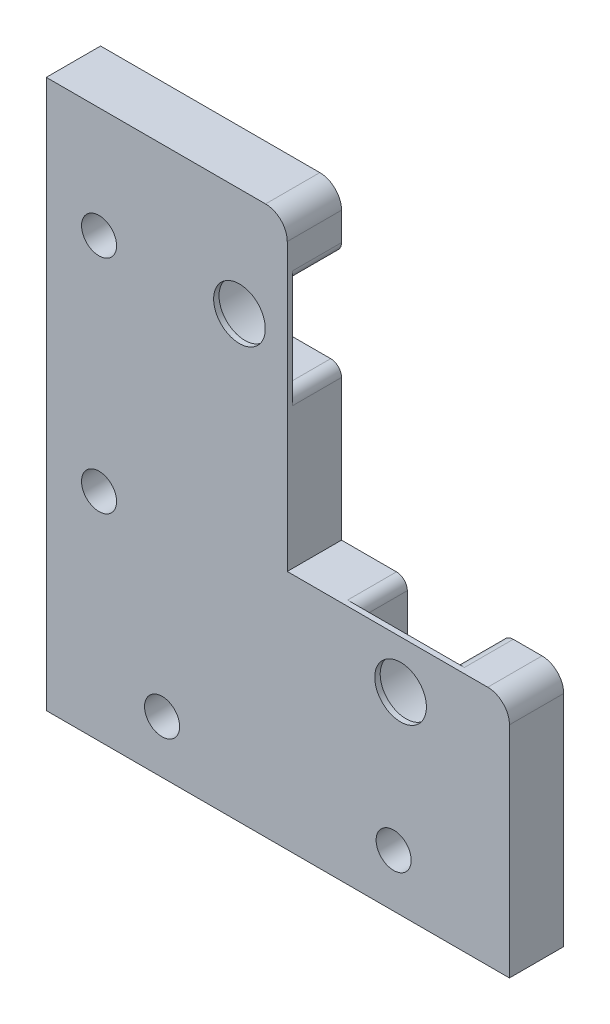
ISO-10303-21;
HEADER;
FILE_DESCRIPTION(('STEP AP214'),'2;1');
FILE_NAME('part.step','',(''),(''),'','','');
FILE_SCHEMA(('AUTOMOTIVE_DESIGN { 1 0 10303 214 1 1 1 1 }'));
ENDSEC;
DATA;
#1=APPLICATION_CONTEXT('core data for automotive mechanical design processes');
#2=APPLICATION_PROTOCOL_DEFINITION('international standard','automotive_design',2000,#1);
#3=PRODUCT_CONTEXT('',#1,'mechanical');
#4=PRODUCT('Part','Part','',(#3));
#5=PRODUCT_RELATED_PRODUCT_CATEGORY('part','',(#4));
#6=PRODUCT_DEFINITION_FORMATION('','',#4);
#7=PRODUCT_DEFINITION_CONTEXT('part definition',#1,'design');
#8=PRODUCT_DEFINITION('design','',#6,#7);
#9=PRODUCT_DEFINITION_SHAPE('','',#8);
#10=(LENGTH_UNIT() NAMED_UNIT(*) SI_UNIT(.MILLI.,.METRE.));
#11=(NAMED_UNIT(*) PLANE_ANGLE_UNIT() SI_UNIT($,.RADIAN.));
#12=(NAMED_UNIT(*) SI_UNIT($,.STERADIAN.) SOLID_ANGLE_UNIT());
#13=UNCERTAINTY_MEASURE_WITH_UNIT(LENGTH_MEASURE(1.E-05),#10,'distance_accuracy_value','');
#14=(GEOMETRIC_REPRESENTATION_CONTEXT(3) GLOBAL_UNCERTAINTY_ASSIGNED_CONTEXT((#13)) GLOBAL_UNIT_ASSIGNED_CONTEXT((#10,
#11,#12)) REPRESENTATION_CONTEXT('',''));
#15=CARTESIAN_POINT('',(0.,0.,0.));
#16=DIRECTION('',(0.,0.,1.));
#17=DIRECTION('',(1.,0.,0.));
#18=AXIS2_PLACEMENT_3D('',#15,#16,#17);
#19=CARTESIAN_POINT('',(0.,0.,-84.4296));
#20=DIRECTION('',(0.,0.,1.));
#21=DIRECTION('',(1.,0.,0.));
#22=AXIS2_PLACEMENT_3D('',#19,#20,#21);
#23=PLANE('',#22);
#24=CARTESIAN_POINT('',(-827.241549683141,599.958054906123,-84.4296));
#25=DIRECTION('',(0.,0.,1.));
#26=DIRECTION('',(1.,0.,0.));
#27=AXIS2_PLACEMENT_3D('',#24,#25,#26);
#28=CIRCLE('',#27,3.31999999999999);
#29=CARTESIAN_POINT('',(-823.921549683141,599.958054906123,-84.4296));
#30=VERTEX_POINT('',#29);
#31=EDGE_CURVE('E490',#30,#30,#28,.T.);
#32=ORIENTED_EDGE('',*,*,#31,.T.);
#33=EDGE_LOOP('',(#32));
#34=FACE_BOUND('',#33,.T.);
#35=CARTESIAN_POINT('',(-827.241549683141,574.047256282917,-84.4296));
#36=DIRECTION('',(0.,0.,1.));
#37=DIRECTION('',(1.,0.,0.));
#38=AXIS2_PLACEMENT_3D('',#35,#36,#37);
#39=CIRCLE('',#38,3.31999999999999);
#40=CARTESIAN_POINT('',(-823.921549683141,574.047256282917,-84.4296));
#41=VERTEX_POINT('',#40);
#42=EDGE_CURVE('E487',#41,#41,#39,.T.);
#43=ORIENTED_EDGE('',*,*,#42,.T.);
#44=EDGE_LOOP('',(#43));
#45=FACE_BOUND('',#44,.T.);
#46=CARTESIAN_POINT('',(-819.866559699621,554.919656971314,-84.4296));
#47=DIRECTION('',(0.,0.,1.));
#48=DIRECTION('',(1.,0.,0.));
#49=AXIS2_PLACEMENT_3D('',#46,#47,#48);
#50=CIRCLE('',#49,3.31999999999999);
#51=CARTESIAN_POINT('',(-816.546559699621,554.919656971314,-84.4296));
#52=VERTEX_POINT('',#51);
#53=EDGE_CURVE('E484',#52,#52,#50,.T.);
#54=ORIENTED_EDGE('',*,*,#53,.T.);
#55=EDGE_LOOP('',(#54));
#56=FACE_BOUND('',#55,.T.);
#57=CARTESIAN_POINT('',(-792.772179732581,554.919656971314,-84.4296));
#58=DIRECTION('',(0.,0.,1.));
#59=DIRECTION('',(1.,0.,0.));
#60=AXIS2_PLACEMENT_3D('',#57,#58,#59);
#61=CIRCLE('',#60,3.31999999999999);
#62=CARTESIAN_POINT('',(-789.452179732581,554.919656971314,-84.4296));
#63=VERTEX_POINT('',#62);
#64=EDGE_CURVE('E481',#63,#63,#61,.T.);
#65=ORIENTED_EDGE('',*,*,#64,.T.);
#66=EDGE_LOOP('',(#65));
#67=FACE_BOUND('',#66,.T.);
#68=DIRECTION('',(0.,1.,0.));
#69=VECTOR('',#68,1.);
#70=CARTESIAN_POINT('',(-833.413749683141,0.,-84.4296));
#71=LINE('',#70,#69);
#72=CARTESIAN_POINT('',(-833.413749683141,548.747456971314,-84.4296));
#73=VERTEX_POINT('',#72);
#74=CARTESIAN_POINT('',(-833.413749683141,612.913454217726,-84.4296));
#75=VERTEX_POINT('',#74);
#76=EDGE_CURVE('E267',#73,#75,#71,.T.);
#77=ORIENTED_EDGE('',*,*,#76,.T.);
#78=DIRECTION('',(1.,0.,0.));
#79=VECTOR('',#78,1.);
#80=CARTESIAN_POINT('',(-827.063749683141,612.913454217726,-84.4296));
#81=LINE('',#80,#79);
#82=CARTESIAN_POINT('',(-807.759749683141,612.913454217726,-84.4296));
#83=VERTEX_POINT('',#82);
#84=EDGE_CURVE('E255',#75,#83,#81,.T.);
#85=ORIENTED_EDGE('',*,*,#84,.T.);
#86=CARTESIAN_POINT('',(-807.759749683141,610.373454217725,-84.4296));
#87=DIRECTION('',(0.,0.,1.));
#88=DIRECTION('',(1.,0.,0.));
#89=AXIS2_PLACEMENT_3D('',#86,#87,#88);
#90=CIRCLE('',#89,2.54);
#91=CARTESIAN_POINT('',(-805.219749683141,610.373454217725,-84.4296));
#92=VERTEX_POINT('',#91);
#93=EDGE_CURVE('E114',#83,#92,#90,.F.);
#94=ORIENTED_EDGE('',*,*,#93,.T.);
#95=DIRECTION('',(0.,-1.,0.));
#96=VECTOR('',#95,1.);
#97=CARTESIAN_POINT('',(-805.219749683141,612.913454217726,-84.4296));
#98=LINE('',#97,#96);
#99=CARTESIAN_POINT('',(-805.219749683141,607.091256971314,-84.4296));
#100=VERTEX_POINT('',#99);
#101=EDGE_CURVE('E355',#92,#100,#98,.T.);
#102=ORIENTED_EDGE('',*,*,#101,.T.);
#103=CARTESIAN_POINT('',(-806.489749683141,607.091256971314,-84.4296));
#104=DIRECTION('',(0.,0.,1.));
#105=DIRECTION('',(1.,0.,0.));
#106=AXIS2_PLACEMENT_3D('',#103,#104,#105);
#107=CIRCLE('',#106,1.27);
#108=CARTESIAN_POINT('',(-806.489749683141,605.821256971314,-84.4296));
#109=VERTEX_POINT('',#108);
#110=EDGE_CURVE('E417',#100,#109,#107,.F.);
#111=ORIENTED_EDGE('',*,*,#110,.T.);
#112=DIRECTION('',(1.,0.,0.));
#113=VECTOR('',#112,1.);
#114=CARTESIAN_POINT('',(0.,605.821256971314,-84.4296));
#115=LINE('',#114,#113);
#116=CARTESIAN_POINT('',(-810.814099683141,605.821256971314,-84.4296));
#117=VERTEX_POINT('',#116);
#118=EDGE_CURVE('E335',#117,#109,#115,.T.);
#119=ORIENTED_EDGE('',*,*,#118,.F.);
#120=CARTESIAN_POINT('',(-810.814099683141,600.258656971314,-84.4296));
#121=DIRECTION('',(0.,0.,-1.));
#122=DIRECTION('',(-1.,0.,0.));
#123=AXIS2_PLACEMENT_3D('',#120,#121,#122);
#124=CIRCLE('',#123,5.56260000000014);
#125=CARTESIAN_POINT('',(-810.814099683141,594.696056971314,-84.4296));
#126=VERTEX_POINT('',#125);
#127=EDGE_CURVE('E310',#126,#117,#124,.T.);
#128=ORIENTED_EDGE('',*,*,#127,.F.);
#129=DIRECTION('',(1.,0.,0.));
#130=VECTOR('',#129,1.);
#131=CARTESIAN_POINT('',(0.,594.696056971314,-84.4296));
#132=LINE('',#131,#130);
#133=CARTESIAN_POINT('',(-806.489749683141,594.696056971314,-84.4296));
#134=VERTEX_POINT('',#133);
#135=EDGE_CURVE('E331',#126,#134,#132,.T.);
#136=ORIENTED_EDGE('',*,*,#135,.T.);
#137=CARTESIAN_POINT('',(-806.489749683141,593.426056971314,-84.4296));
#138=DIRECTION('',(0.,0.,1.));
#139=DIRECTION('',(1.,0.,0.));
#140=AXIS2_PLACEMENT_3D('',#137,#138,#139);
#141=CIRCLE('',#140,1.27);
#142=CARTESIAN_POINT('',(-805.219749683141,593.426056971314,-84.4296));
#143=VERTEX_POINT('',#142);
#144=EDGE_CURVE('E414',#134,#143,#141,.F.);
#145=ORIENTED_EDGE('',*,*,#144,.T.);
#146=CARTESIAN_POINT('',(-805.219749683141,576.941456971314,-84.4296));
#147=VERTEX_POINT('',#146);
#148=EDGE_CURVE('E359',#143,#147,#98,.T.);
#149=ORIENTED_EDGE('',*,*,#148,.T.);
#150=DIRECTION('',(1.,0.,0.));
#151=VECTOR('',#150,1.);
#152=CARTESIAN_POINT('',(-805.219749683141,576.941456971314,-84.4296));
#153=LINE('',#152,#151);
#154=CARTESIAN_POINT('',(-798.793549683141,576.941456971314,-84.4296));
#155=VERTEX_POINT('',#154);
#156=EDGE_CURVE('E256',#147,#155,#153,.T.);
#157=ORIENTED_EDGE('',*,*,#156,.T.);
#158=CARTESIAN_POINT('',(-798.793549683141,575.671456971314,-84.4296));
#159=DIRECTION('',(0.,0.,1.));
#160=DIRECTION('',(1.,0.,0.));
#161=AXIS2_PLACEMENT_3D('',#158,#159,#160);
#162=CIRCLE('',#161,1.27);
#163=CARTESIAN_POINT('',(-797.523549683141,575.671456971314,-84.4296));
#164=VERTEX_POINT('',#163);
#165=EDGE_CURVE('E411',#155,#164,#162,.F.);
#166=ORIENTED_EDGE('',*,*,#165,.T.);
#167=DIRECTION('',(0.,1.,0.));
#168=VECTOR('',#167,1.);
#169=CARTESIAN_POINT('',(-797.523549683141,0.,-84.4296));
#170=LINE('',#169,#168);
#171=CARTESIAN_POINT('',(-797.523549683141,571.347106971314,-84.4296));
#172=VERTEX_POINT('',#171);
#173=EDGE_CURVE('E309',#172,#164,#170,.T.);
#174=ORIENTED_EDGE('',*,*,#173,.F.);
#175=CARTESIAN_POINT('',(-791.960949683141,571.347106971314,-84.4296));
#176=DIRECTION('',(0.,0.,-1.));
#177=DIRECTION('',(-1.,0.,0.));
#178=AXIS2_PLACEMENT_3D('',#175,#176,#177);
#179=CIRCLE('',#178,5.5626);
#180=CARTESIAN_POINT('',(-786.398349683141,571.347106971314,-84.4296));
#181=VERTEX_POINT('',#180);
#182=EDGE_CURVE('E306',#181,#172,#179,.T.);
#183=ORIENTED_EDGE('',*,*,#182,.F.);
#184=DIRECTION('',(0.,1.,0.));
#185=VECTOR('',#184,1.);
#186=CARTESIAN_POINT('',(-786.398349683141,0.,-84.4296));
#187=LINE('',#186,#185);
#188=CARTESIAN_POINT('',(-786.398349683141,575.671456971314,-84.4296));
#189=VERTEX_POINT('',#188);
#190=EDGE_CURVE('E294',#181,#189,#187,.T.);
#191=ORIENTED_EDGE('',*,*,#190,.T.);
#192=CARTESIAN_POINT('',(-785.128349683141,575.671456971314,-84.4296));
#193=DIRECTION('',(0.,0.,1.));
#194=DIRECTION('',(1.,0.,0.));
#195=AXIS2_PLACEMENT_3D('',#192,#193,#194);
#196=CIRCLE('',#195,1.27);
#197=CARTESIAN_POINT('',(-785.128349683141,576.941456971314,-84.4296));
#198=VERTEX_POINT('',#197);
#199=EDGE_CURVE('E408',#189,#198,#196,.F.);
#200=ORIENTED_EDGE('',*,*,#199,.T.);
#201=CARTESIAN_POINT('',(-781.764989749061,576.941456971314,-84.4296));
#202=VERTEX_POINT('',#201);
#203=EDGE_CURVE('E358',#198,#202,#153,.T.);
#204=ORIENTED_EDGE('',*,*,#203,.T.);
#205=CARTESIAN_POINT('',(-781.764989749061,574.401456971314,-84.4296));
#206=DIRECTION('',(0.,0.,1.));
#207=DIRECTION('',(1.,0.,0.));
#208=AXIS2_PLACEMENT_3D('',#205,#206,#207);
#209=CIRCLE('',#208,2.54);
#210=CARTESIAN_POINT('',(-779.224989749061,574.401456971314,-84.4296));
#211=VERTEX_POINT('',#210);
#212=EDGE_CURVE('E250',#202,#211,#209,.F.);
#213=ORIENTED_EDGE('',*,*,#212,.T.);
#214=DIRECTION('',(0.,-1.,0.));
#215=VECTOR('',#214,1.);
#216=CARTESIAN_POINT('',(-779.224989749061,576.941456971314,-84.4296));
#217=LINE('',#216,#215);
#218=CARTESIAN_POINT('',(-779.224989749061,548.747456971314,-84.4296));
#219=VERTEX_POINT('',#218);
#220=EDGE_CURVE('E243',#211,#219,#217,.T.);
#221=ORIENTED_EDGE('',*,*,#220,.T.);
#222=DIRECTION('',(-1.,0.,0.));
#223=VECTOR('',#222,1.);
#224=CARTESIAN_POINT('',(0.,548.747456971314,-84.4296));
#225=LINE('',#224,#223);
#226=EDGE_CURVE('E247',#219,#73,#225,.T.);
#227=ORIENTED_EDGE('',*,*,#226,.T.);
#228=EDGE_LOOP('',(#77,#85,#94,#102,#111,#119,#128,#136,#145,#149,#157,#166,#174,#183,#191,#200,
#204,#213,#221,#227));
#229=FACE_BOUND('',#228,.T.);
#230=ADVANCED_FACE('F91',(#34,#45,#56,#67,#229),#23,.F.);
#231=CARTESIAN_POINT('',(0.,0.,-78.0796));
#232=DIRECTION('',(0.,0.,-1.));
#233=DIRECTION('',(-1.,0.,0.));
#234=AXIS2_PLACEMENT_3D('',#231,#232,#233);
#235=PLANE('',#234);
#236=CARTESIAN_POINT('',(-792.772179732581,554.919656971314,-78.0796));
#237=DIRECTION('',(0.,0.,-1.));
#238=DIRECTION('',(-1.,0.,0.));
#239=AXIS2_PLACEMENT_3D('',#236,#237,#238);
#240=CIRCLE('',#239,2.05000000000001);
#241=CARTESIAN_POINT('',(-794.822179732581,554.919656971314,-78.0796));
#242=VERTEX_POINT('',#241);
#243=EDGE_CURVE('E272',#242,#242,#240,.T.);
#244=ORIENTED_EDGE('',*,*,#243,.T.);
#245=EDGE_LOOP('',(#244));
#246=FACE_BOUND('',#245,.T.);
#247=CARTESIAN_POINT('',(-827.241549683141,599.958054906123,-78.0796));
#248=DIRECTION('',(0.,0.,-1.));
#249=DIRECTION('',(-1.,0.,0.));
#250=AXIS2_PLACEMENT_3D('',#247,#248,#249);
#251=CIRCLE('',#250,2.05000000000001);
#252=CARTESIAN_POINT('',(-829.291549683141,599.958054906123,-78.0796));
#253=VERTEX_POINT('',#252);
#254=EDGE_CURVE('E532',#253,#253,#251,.T.);
#255=ORIENTED_EDGE('',*,*,#254,.T.);
#256=EDGE_LOOP('',(#255));
#257=FACE_BOUND('',#256,.T.);
#258=DIRECTION('',(1.,0.,0.));
#259=VECTOR('',#258,1.);
#260=CARTESIAN_POINT('',(0.,548.747456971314,-78.0796));
#261=LINE('',#260,#259);
#262=CARTESIAN_POINT('',(-833.413749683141,548.747456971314,-78.0796));
#263=VERTEX_POINT('',#262);
#264=CARTESIAN_POINT('',(-779.224989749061,548.747456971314,-78.0796));
#265=VERTEX_POINT('',#264);
#266=EDGE_CURVE('E286',#263,#265,#261,.T.);
#267=ORIENTED_EDGE('',*,*,#266,.T.);
#268=DIRECTION('',(0.,-1.,0.));
#269=VECTOR('',#268,1.);
#270=CARTESIAN_POINT('',(-779.224989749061,562.158656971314,-78.0796));
#271=LINE('',#270,#269);
#272=CARTESIAN_POINT('',(-779.224989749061,574.401456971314,-78.0796));
#273=VERTEX_POINT('',#272);
#274=EDGE_CURVE('E262',#273,#265,#271,.T.);
#275=ORIENTED_EDGE('',*,*,#274,.F.);
#276=CARTESIAN_POINT('',(-781.764989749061,574.401456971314,-78.0796));
#277=DIRECTION('',(0.,0.,-1.));
#278=DIRECTION('',(-1.,0.,0.));
#279=AXIS2_PLACEMENT_3D('',#276,#277,#278);
#280=CIRCLE('',#279,2.54);
#281=CARTESIAN_POINT('',(-781.764989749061,576.941456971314,-78.0796));
#282=VERTEX_POINT('',#281);
#283=EDGE_CURVE('E462',#273,#282,#280,.F.);
#284=ORIENTED_EDGE('',*,*,#283,.T.);
#285=DIRECTION('',(1.,0.,0.));
#286=VECTOR('',#285,1.);
#287=CARTESIAN_POINT('',(-804.660949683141,576.941456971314,-78.0796));
#288=LINE('',#287,#286);
#289=CARTESIAN_POINT('',(-805.219749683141,576.941456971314,-78.0796));
#290=VERTEX_POINT('',#289);
#291=EDGE_CURVE('E379',#290,#282,#288,.T.);
#292=ORIENTED_EDGE('',*,*,#291,.F.);
#293=DIRECTION('',(0.,-1.,0.));
#294=VECTOR('',#293,1.);
#295=CARTESIAN_POINT('',(-805.219749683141,612.913454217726,-78.0796));
#296=LINE('',#295,#294);
#297=CARTESIAN_POINT('',(-805.219749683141,610.373454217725,-78.0796));
#298=VERTEX_POINT('',#297);
#299=EDGE_CURVE('E388',#298,#290,#296,.T.);
#300=ORIENTED_EDGE('',*,*,#299,.F.);
#301=CARTESIAN_POINT('',(-807.759749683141,610.373454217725,-78.0796));
#302=DIRECTION('',(0.,0.,-1.));
#303=DIRECTION('',(-1.,0.,0.));
#304=AXIS2_PLACEMENT_3D('',#301,#302,#303);
#305=CIRCLE('',#304,2.54);
#306=CARTESIAN_POINT('',(-807.759749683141,612.913454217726,-78.0796));
#307=VERTEX_POINT('',#306);
#308=EDGE_CURVE('E459',#298,#307,#305,.F.);
#309=ORIENTED_EDGE('',*,*,#308,.T.);
#310=DIRECTION('',(1.,0.,0.));
#311=VECTOR('',#310,1.);
#312=CARTESIAN_POINT('',(-820.002549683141,612.913454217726,-78.0796));
#313=LINE('',#312,#311);
#314=CARTESIAN_POINT('',(-833.413749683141,612.913454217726,-78.0796));
#315=VERTEX_POINT('',#314);
#316=EDGE_CURVE('E385',#315,#307,#313,.T.);
#317=ORIENTED_EDGE('',*,*,#316,.F.);
#318=DIRECTION('',(0.,-1.,0.));
#319=VECTOR('',#318,1.);
#320=CARTESIAN_POINT('',(-833.413749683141,0.,-78.0796));
#321=LINE('',#320,#319);
#322=EDGE_CURVE('E279',#315,#263,#321,.T.);
#323=ORIENTED_EDGE('',*,*,#322,.T.);
#324=EDGE_LOOP('',(#267,#275,#284,#292,#300,#309,#317,#323));
#325=FACE_BOUND('',#324,.T.);
#326=CARTESIAN_POINT('',(-810.814099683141,600.258656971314,-78.0796));
#327=DIRECTION('',(0.,0.,1.));
#328=DIRECTION('',(-1.,0.,0.));
#329=AXIS2_PLACEMENT_3D('',#326,#327,#328);
#330=CIRCLE('',#329,3.0226);
#331=CARTESIAN_POINT('',(-813.836699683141,600.258656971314,-78.0796));
#332=VERTEX_POINT('',#331);
#333=EDGE_CURVE('E365',#332,#332,#330,.T.);
#334=ORIENTED_EDGE('',*,*,#333,.F.);
#335=EDGE_LOOP('',(#334));
#336=FACE_BOUND('',#335,.T.);
#337=CARTESIAN_POINT('',(-791.960949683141,571.347106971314,-78.0796));
#338=DIRECTION('',(0.,0.,1.));
#339=DIRECTION('',(-1.,0.,0.));
#340=AXIS2_PLACEMENT_3D('',#337,#338,#339);
#341=CIRCLE('',#340,3.0226);
#342=CARTESIAN_POINT('',(-794.983549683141,571.347106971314,-78.0796));
#343=VERTEX_POINT('',#342);
#344=EDGE_CURVE('E372',#343,#343,#341,.T.);
#345=ORIENTED_EDGE('',*,*,#344,.F.);
#346=EDGE_LOOP('',(#345));
#347=FACE_BOUND('',#346,.T.);
#348=CARTESIAN_POINT('',(-827.241549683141,574.047256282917,-78.0796));
#349=DIRECTION('',(0.,0.,-1.));
#350=DIRECTION('',(-1.,0.,0.));
#351=AXIS2_PLACEMENT_3D('',#348,#349,#350);
#352=CIRCLE('',#351,2.05000000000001);
#353=CARTESIAN_POINT('',(-829.291549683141,574.047256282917,-78.0796));
#354=VERTEX_POINT('',#353);
#355=EDGE_CURVE('E541',#354,#354,#352,.F.);
#356=ORIENTED_EDGE('',*,*,#355,.F.);
#357=EDGE_LOOP('',(#356));
#358=FACE_BOUND('',#357,.T.);
#359=CARTESIAN_POINT('',(-819.866559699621,554.919656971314,-78.0796));
#360=DIRECTION('',(0.,0.,-1.));
#361=DIRECTION('',(-1.,0.,0.));
#362=AXIS2_PLACEMENT_3D('',#359,#360,#361);
#363=CIRCLE('',#362,2.05000000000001);
#364=CARTESIAN_POINT('',(-821.916559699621,554.919656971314,-78.0796));
#365=VERTEX_POINT('',#364);
#366=EDGE_CURVE('E276',#365,#365,#363,.F.);
#367=ORIENTED_EDGE('',*,*,#366,.F.);
#368=EDGE_LOOP('',(#367));
#369=FACE_BOUND('',#368,.T.);
#370=ADVANCED_FACE('F509',(#246,#257,#325,#336,#347,#358,#369),#235,.F.);
#371=CARTESIAN_POINT('',(-804.660949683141,576.941456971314,-80.6196));
#372=DIRECTION('',(0.,-1.,0.));
#373=DIRECTION('',(0.,0.,-1.));
#374=AXIS2_PLACEMENT_3D('',#371,#372,#373);
#375=PLANE('',#374);
#376=ORIENTED_EDGE('',*,*,#291,.T.);
#377=DIRECTION('',(0.,0.,1.));
#378=VECTOR('',#377,1.);
#379=CARTESIAN_POINT('',(-781.764989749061,576.941456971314,-84.4296));
#380=LINE('',#379,#378);
#381=EDGE_CURVE('E465',#282,#202,#380,.F.);
#382=ORIENTED_EDGE('',*,*,#381,.T.);
#383=ORIENTED_EDGE('',*,*,#203,.F.);
#384=DIRECTION('',(0.,0.,-1.));
#385=VECTOR('',#384,1.);
#386=CARTESIAN_POINT('',(-785.128349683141,576.941456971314,-78.7146));
#387=LINE('',#386,#385);
#388=CARTESIAN_POINT('',(-785.128349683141,576.941456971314,-78.7146));
#389=VERTEX_POINT('',#388);
#390=EDGE_CURVE('E427',#198,#389,#387,.F.);
#391=ORIENTED_EDGE('',*,*,#390,.T.);
#392=DIRECTION('',(1.,0.,0.));
#393=VECTOR('',#392,1.);
#394=CARTESIAN_POINT('',(0.,576.941456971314,-78.7146));
#395=LINE('',#394,#393);
#396=CARTESIAN_POINT('',(-798.793549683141,576.941456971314,-78.7146));
#397=VERTEX_POINT('',#396);
#398=EDGE_CURVE('E298',#397,#389,#395,.T.);
#399=ORIENTED_EDGE('',*,*,#398,.F.);
#400=DIRECTION('',(0.,0.,-1.));
#401=VECTOR('',#400,1.);
#402=CARTESIAN_POINT('',(-798.793549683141,576.941456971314,-80.6196));
#403=LINE('',#402,#401);
#404=EDGE_CURVE('E431',#397,#155,#403,.T.);
#405=ORIENTED_EDGE('',*,*,#404,.T.);
#406=ORIENTED_EDGE('',*,*,#156,.F.);
#407=DIRECTION('',(0.,0.,1.));
#408=VECTOR('',#407,1.);
#409=CARTESIAN_POINT('',(-805.219749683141,576.941456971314,-80.6196));
#410=LINE('',#409,#408);
#411=EDGE_CURVE('E391',#147,#290,#410,.T.);
#412=ORIENTED_EDGE('',*,*,#411,.T.);
#413=EDGE_LOOP('',(#376,#382,#383,#391,#399,#405,#406,#412));
#414=FACE_BOUND('',#413,.T.);
#415=ADVANCED_FACE('F527',(#414),#375,.F.);
#416=CARTESIAN_POINT('',(-805.219749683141,612.913454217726,-80.6196));
#417=DIRECTION('',(-1.,0.,0.));
#418=DIRECTION('',(0.,0.,1.));
#419=AXIS2_PLACEMENT_3D('',#416,#417,#418);
#420=PLANE('',#419);
#421=ORIENTED_EDGE('',*,*,#101,.F.);
#422=DIRECTION('',(0.,0.,1.));
#423=VECTOR('',#422,1.);
#424=CARTESIAN_POINT('',(-805.219749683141,610.373454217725,-78.0796));
#425=LINE('',#424,#423);
#426=EDGE_CURVE('E472',#92,#298,#425,.T.);
#427=ORIENTED_EDGE('',*,*,#426,.T.);
#428=ORIENTED_EDGE('',*,*,#299,.T.);
#429=ORIENTED_EDGE('',*,*,#411,.F.);
#430=ORIENTED_EDGE('',*,*,#148,.F.);
#431=DIRECTION('',(0.,0.,-1.));
#432=VECTOR('',#431,1.);
#433=CARTESIAN_POINT('',(-805.219749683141,593.426056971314,-78.7146));
#434=LINE('',#433,#432);
#435=CARTESIAN_POINT('',(-805.219749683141,593.426056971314,-78.7146));
#436=VERTEX_POINT('',#435);
#437=EDGE_CURVE('E395',#143,#436,#434,.F.);
#438=ORIENTED_EDGE('',*,*,#437,.T.);
#439=DIRECTION('',(0.,-1.,0.));
#440=VECTOR('',#439,1.);
#441=CARTESIAN_POINT('',(-805.219749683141,0.,-78.7146));
#442=LINE('',#441,#440);
#443=CARTESIAN_POINT('',(-805.219749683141,607.091256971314,-78.7146));
#444=VERTEX_POINT('',#443);
#445=EDGE_CURVE('E345',#444,#436,#442,.T.);
#446=ORIENTED_EDGE('',*,*,#445,.F.);
#447=DIRECTION('',(0.,0.,-1.));
#448=VECTOR('',#447,1.);
#449=CARTESIAN_POINT('',(-805.219749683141,607.091256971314,-80.6196));
#450=LINE('',#449,#448);
#451=EDGE_CURVE('E404',#444,#100,#450,.T.);
#452=ORIENTED_EDGE('',*,*,#451,.T.);
#453=EDGE_LOOP('',(#421,#427,#428,#429,#430,#438,#446,#452));
#454=FACE_BOUND('',#453,.T.);
#455=ADVANCED_FACE('F607',(#454),#420,.F.);
#456=CARTESIAN_POINT('',(-791.960949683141,571.347106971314,-78.0796));
#457=DIRECTION('',(0.,0.,-1.));
#458=DIRECTION('',(-1.,0.,0.));
#459=AXIS2_PLACEMENT_3D('',#456,#457,#458);
#460=CYLINDRICAL_SURFACE('',#459,3.0226);
#461=CARTESIAN_POINT('',(-791.960949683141,571.347106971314,-78.7146));
#462=DIRECTION('',(0.,0.,-1.));
#463=DIRECTION('',(-1.,0.,0.));
#464=AXIS2_PLACEMENT_3D('',#461,#462,#463);
#465=CIRCLE('',#464,3.0226);
#466=CARTESIAN_POINT('',(-794.983549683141,571.347106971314,-78.7146));
#467=VERTEX_POINT('',#466);
#468=EDGE_CURVE('E398',#467,#467,#465,.F.);
#469=ORIENTED_EDGE('',*,*,#468,.F.);
#470=DIRECTION('',(0.,0.,-1.));
#471=VECTOR('',#470,1.);
#472=CARTESIAN_POINT('',(-794.983549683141,571.347106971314,-78.0796));
#473=LINE('',#472,#471);
#474=EDGE_CURVE('E375',#343,#467,#473,.T.);
#475=ORIENTED_EDGE('',*,*,#474,.F.);
#476=ORIENTED_EDGE('',*,*,#344,.T.);
#477=ORIENTED_EDGE('',*,*,#474,.T.);
#478=EDGE_LOOP('',(#469,#475,#476,#477));
#479=FACE_BOUND('',#478,.T.);
#480=ADVANCED_FACE('F604',(#479),#460,.F.);
#481=CARTESIAN_POINT('',(-810.814099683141,600.258656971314,-78.0796));
#482=DIRECTION('',(0.,0.,-1.));
#483=DIRECTION('',(-1.,0.,0.));
#484=AXIS2_PLACEMENT_3D('',#481,#482,#483);
#485=CYLINDRICAL_SURFACE('',#484,3.0226);
#486=CARTESIAN_POINT('',(-810.814099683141,600.258656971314,-78.7146));
#487=DIRECTION('',(0.,0.,-1.));
#488=DIRECTION('',(-1.,0.,0.));
#489=AXIS2_PLACEMENT_3D('',#486,#487,#488);
#490=CIRCLE('',#489,3.0226);
#491=CARTESIAN_POINT('',(-813.836699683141,600.258656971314,-78.7146));
#492=VERTEX_POINT('',#491);
#493=EDGE_CURVE('E320',#492,#492,#490,.F.);
#494=ORIENTED_EDGE('',*,*,#493,.F.);
#495=DIRECTION('',(0.,0.,-1.));
#496=VECTOR('',#495,1.);
#497=CARTESIAN_POINT('',(-813.836699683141,600.258656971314,-78.0796));
#498=LINE('',#497,#496);
#499=EDGE_CURVE('E368',#332,#492,#498,.T.);
#500=ORIENTED_EDGE('',*,*,#499,.F.);
#501=ORIENTED_EDGE('',*,*,#333,.T.);
#502=ORIENTED_EDGE('',*,*,#499,.T.);
#503=EDGE_LOOP('',(#494,#500,#501,#502));
#504=FACE_BOUND('',#503,.T.);
#505=ADVANCED_FACE('F601',(#504),#485,.F.);
#506=CARTESIAN_POINT('',(-779.224989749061,0.,6.35));
#507=DIRECTION('',(1.,0.,0.));
#508=DIRECTION('',(0.,0.,-1.));
#509=AXIS2_PLACEMENT_3D('',#506,#507,#508);
#510=PLANE('',#509);
#511=ORIENTED_EDGE('',*,*,#274,.T.);
#512=DIRECTION('',(0.,0.,-1.));
#513=VECTOR('',#512,1.);
#514=CARTESIAN_POINT('',(-779.224989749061,548.747456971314,5.90668998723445));
#515=LINE('',#514,#513);
#516=EDGE_CURVE('E259',#265,#219,#515,.T.);
#517=ORIENTED_EDGE('',*,*,#516,.T.);
#518=ORIENTED_EDGE('',*,*,#220,.F.);
#519=DIRECTION('',(0.,0.,1.));
#520=VECTOR('',#519,1.);
#521=CARTESIAN_POINT('',(-779.224989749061,574.401456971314,-78.0796));
#522=LINE('',#521,#520);
#523=EDGE_CURVE('E456',#211,#273,#522,.T.);
#524=ORIENTED_EDGE('',*,*,#523,.T.);
#525=EDGE_LOOP('',(#511,#517,#518,#524));
#526=FACE_BOUND('',#525,.T.);
#527=ADVANCED_FACE('F260',(#526),#510,.T.);
#528=CARTESIAN_POINT('',(0.,612.913454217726,6.35));
#529=DIRECTION('',(0.,1.,0.));
#530=DIRECTION('',(0.,0.,1.));
#531=AXIS2_PLACEMENT_3D('',#528,#529,#530);
#532=PLANE('',#531);
#533=ORIENTED_EDGE('',*,*,#84,.F.);
#534=DIRECTION('',(0.,0.,-1.));
#535=VECTOR('',#534,1.);
#536=CARTESIAN_POINT('',(-833.413749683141,612.913454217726,5.90668998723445));
#537=LINE('',#536,#535);
#538=EDGE_CURVE('E282',#315,#75,#537,.T.);
#539=ORIENTED_EDGE('',*,*,#538,.F.);
#540=ORIENTED_EDGE('',*,*,#316,.T.);
#541=DIRECTION('',(0.,0.,1.));
#542=VECTOR('',#541,1.);
#543=CARTESIAN_POINT('',(-807.759749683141,612.913454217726,-84.4296));
#544=LINE('',#543,#542);
#545=EDGE_CURVE('E107',#307,#83,#544,.F.);
#546=ORIENTED_EDGE('',*,*,#545,.T.);
#547=EDGE_LOOP('',(#533,#539,#540,#546));
#548=FACE_BOUND('',#547,.T.);
#549=ADVANCED_FACE('F598',(#548),#532,.T.);
#550=CARTESIAN_POINT('',(0.,0.,-78.7146));
#551=DIRECTION('',(0.,0.,-1.));
#552=DIRECTION('',(-1.,0.,0.));
#553=AXIS2_PLACEMENT_3D('',#550,#551,#552);
#554=PLANE('',#553);
#555=CARTESIAN_POINT('',(-810.814099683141,600.258656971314,-78.7146));
#556=DIRECTION('',(0.,0.,-1.));
#557=DIRECTION('',(-1.,0.,0.));
#558=AXIS2_PLACEMENT_3D('',#555,#556,#557);
#559=CIRCLE('',#558,5.56260000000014);
#560=CARTESIAN_POINT('',(-810.814099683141,594.696056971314,-78.7146));
#561=VERTEX_POINT('',#560);
#562=CARTESIAN_POINT('',(-810.814099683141,605.821256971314,-78.7146));
#563=VERTEX_POINT('',#562);
#564=EDGE_CURVE('E336',#561,#563,#559,.T.);
#565=ORIENTED_EDGE('',*,*,#564,.T.);
#566=DIRECTION('',(1.,0.,0.));
#567=VECTOR('',#566,1.);
#568=CARTESIAN_POINT('',(0.,605.821256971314,-78.7146));
#569=LINE('',#568,#567);
#570=CARTESIAN_POINT('',(-806.489749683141,605.821256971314,-78.7146));
#571=VERTEX_POINT('',#570);
#572=EDGE_CURVE('E348',#563,#571,#569,.T.);
#573=ORIENTED_EDGE('',*,*,#572,.T.);
#574=CARTESIAN_POINT('',(-806.489749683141,607.091256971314,-78.7146));
#575=DIRECTION('',(0.,0.,-1.));
#576=DIRECTION('',(-1.,0.,0.));
#577=AXIS2_PLACEMENT_3D('',#574,#575,#576);
#578=CIRCLE('',#577,1.27);
#579=EDGE_CURVE('E442',#571,#444,#578,.F.);
#580=ORIENTED_EDGE('',*,*,#579,.T.);
#581=ORIENTED_EDGE('',*,*,#445,.T.);
#582=CARTESIAN_POINT('',(-806.489749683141,593.426056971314,-78.7146));
#583=DIRECTION('',(0.,0.,-1.));
#584=DIRECTION('',(-1.,0.,0.));
#585=AXIS2_PLACEMENT_3D('',#582,#583,#584);
#586=CIRCLE('',#585,1.27);
#587=CARTESIAN_POINT('',(-806.489749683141,594.696056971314,-78.7146));
#588=VERTEX_POINT('',#587);
#589=EDGE_CURVE('E446',#436,#588,#586,.F.);
#590=ORIENTED_EDGE('',*,*,#589,.T.);
#591=DIRECTION('',(1.,0.,0.));
#592=VECTOR('',#591,1.);
#593=CARTESIAN_POINT('',(0.,594.696056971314,-78.7146));
#594=LINE('',#593,#592);
#595=EDGE_CURVE('E328',#561,#588,#594,.T.);
#596=ORIENTED_EDGE('',*,*,#595,.F.);
#597=EDGE_LOOP('',(#565,#573,#580,#581,#590,#596));
#598=FACE_BOUND('',#597,.T.);
#599=ORIENTED_EDGE('',*,*,#493,.T.);
#600=EDGE_LOOP('',(#599));
#601=FACE_BOUND('',#600,.T.);
#602=ADVANCED_FACE('F589',(#598,#601),#554,.T.);
#603=CARTESIAN_POINT('',(-810.814099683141,600.258656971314,-78.7146));
#604=DIRECTION('',(0.,0.,-1.));
#605=DIRECTION('',(-1.,0.,0.));
#606=AXIS2_PLACEMENT_3D('',#603,#604,#605);
#607=CYLINDRICAL_SURFACE('',#606,5.56260000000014);
#608=ORIENTED_EDGE('',*,*,#127,.T.);
#609=DIRECTION('',(0.,0.,-1.));
#610=VECTOR('',#609,1.);
#611=CARTESIAN_POINT('',(-810.814099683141,605.821256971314,-78.7146));
#612=LINE('',#611,#610);
#613=EDGE_CURVE('E324',#563,#117,#612,.T.);
#614=ORIENTED_EDGE('',*,*,#613,.F.);
#615=ORIENTED_EDGE('',*,*,#564,.F.);
#616=DIRECTION('',(0.,0.,-1.));
#617=VECTOR('',#616,1.);
#618=CARTESIAN_POINT('',(-810.814099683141,594.696056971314,-78.7146));
#619=LINE('',#618,#617);
#620=EDGE_CURVE('E288',#561,#126,#619,.T.);
#621=ORIENTED_EDGE('',*,*,#620,.T.);
#622=EDGE_LOOP('',(#608,#614,#615,#621));
#623=FACE_BOUND('',#622,.T.);
#624=ADVANCED_FACE('F585',(#623),#607,.F.);
#625=CARTESIAN_POINT('',(0.,594.696056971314,-78.7146));
#626=DIRECTION('',(0.,1.,0.));
#627=DIRECTION('',(0.,0.,1.));
#628=AXIS2_PLACEMENT_3D('',#625,#626,#627);
#629=PLANE('',#628);
#630=ORIENTED_EDGE('',*,*,#595,.T.);
#631=DIRECTION('',(0.,0.,-1.));
#632=VECTOR('',#631,1.);
#633=CARTESIAN_POINT('',(-806.489749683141,594.696056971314,-84.4296));
#634=LINE('',#633,#632);
#635=EDGE_CURVE('E423',#588,#134,#634,.T.);
#636=ORIENTED_EDGE('',*,*,#635,.T.);
#637=ORIENTED_EDGE('',*,*,#135,.F.);
#638=ORIENTED_EDGE('',*,*,#620,.F.);
#639=EDGE_LOOP('',(#630,#636,#637,#638));
#640=FACE_BOUND('',#639,.T.);
#641=ADVANCED_FACE('F588',(#640),#629,.T.);
#642=CARTESIAN_POINT('',(0.,605.821256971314,-78.7146));
#643=DIRECTION('',(0.,1.,0.));
#644=DIRECTION('',(0.,0.,1.));
#645=AXIS2_PLACEMENT_3D('',#642,#643,#644);
#646=PLANE('',#645);
#647=ORIENTED_EDGE('',*,*,#118,.T.);
#648=DIRECTION('',(0.,0.,-1.));
#649=VECTOR('',#648,1.);
#650=CARTESIAN_POINT('',(-806.489749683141,605.821256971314,-78.7146));
#651=LINE('',#650,#649);
#652=EDGE_CURVE('E420',#109,#571,#651,.F.);
#653=ORIENTED_EDGE('',*,*,#652,.T.);
#654=ORIENTED_EDGE('',*,*,#572,.F.);
#655=ORIENTED_EDGE('',*,*,#613,.T.);
#656=EDGE_LOOP('',(#647,#653,#654,#655));
#657=FACE_BOUND('',#656,.T.);
#658=ADVANCED_FACE('F571',(#657),#646,.F.);
#659=CARTESIAN_POINT('',(0.,0.,-78.7146));
#660=DIRECTION('',(0.,0.,-1.));
#661=DIRECTION('',(-1.,0.,0.));
#662=AXIS2_PLACEMENT_3D('',#659,#660,#661);
#663=PLANE('',#662);
#664=CARTESIAN_POINT('',(-791.960949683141,571.347106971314,-78.7146));
#665=DIRECTION('',(0.,0.,-1.));
#666=DIRECTION('',(-1.,0.,0.));
#667=AXIS2_PLACEMENT_3D('',#664,#665,#666);
#668=CIRCLE('',#667,5.5626);
#669=CARTESIAN_POINT('',(-786.398349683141,571.347106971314,-78.7146));
#670=VERTEX_POINT('',#669);
#671=CARTESIAN_POINT('',(-797.523549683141,571.347106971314,-78.7146));
#672=VERTEX_POINT('',#671);
#673=EDGE_CURVE('E289',#670,#672,#668,.T.);
#674=ORIENTED_EDGE('',*,*,#673,.T.);
#675=DIRECTION('',(0.,1.,0.));
#676=VECTOR('',#675,1.);
#677=CARTESIAN_POINT('',(-797.523549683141,0.,-78.7146));
#678=LINE('',#677,#676);
#679=CARTESIAN_POINT('',(-797.523549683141,575.671456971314,-78.7146));
#680=VERTEX_POINT('',#679);
#681=EDGE_CURVE('E293',#672,#680,#678,.T.);
#682=ORIENTED_EDGE('',*,*,#681,.T.);
#683=CARTESIAN_POINT('',(-798.793549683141,575.671456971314,-78.7146));
#684=DIRECTION('',(0.,0.,-1.));
#685=DIRECTION('',(-1.,0.,0.));
#686=AXIS2_PLACEMENT_3D('',#683,#684,#685);
#687=CIRCLE('',#686,1.27);
#688=EDGE_CURVE('E449',#680,#397,#687,.F.);
#689=ORIENTED_EDGE('',*,*,#688,.T.);
#690=ORIENTED_EDGE('',*,*,#398,.T.);
#691=CARTESIAN_POINT('',(-785.128349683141,575.671456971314,-78.7146));
#692=DIRECTION('',(0.,0.,-1.));
#693=DIRECTION('',(-1.,0.,0.));
#694=AXIS2_PLACEMENT_3D('',#691,#692,#693);
#695=CIRCLE('',#694,1.27);
#696=CARTESIAN_POINT('',(-786.398349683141,575.671456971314,-78.7146));
#697=VERTEX_POINT('',#696);
#698=EDGE_CURVE('E453',#389,#697,#695,.F.);
#699=ORIENTED_EDGE('',*,*,#698,.T.);
#700=DIRECTION('',(0.,1.,0.));
#701=VECTOR('',#700,1.);
#702=CARTESIAN_POINT('',(-786.398349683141,0.,-78.7146));
#703=LINE('',#702,#701);
#704=EDGE_CURVE('E301',#670,#697,#703,.T.);
#705=ORIENTED_EDGE('',*,*,#704,.F.);
#706=EDGE_LOOP('',(#674,#682,#689,#690,#699,#705));
#707=FACE_BOUND('',#706,.T.);
#708=ORIENTED_EDGE('',*,*,#468,.T.);
#709=EDGE_LOOP('',(#708));
#710=FACE_BOUND('',#709,.T.);
#711=ADVANCED_FACE('F567',(#707,#710),#663,.T.);
#712=CARTESIAN_POINT('',(-791.960949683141,571.347106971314,-78.7146));
#713=DIRECTION('',(0.,0.,-1.));
#714=DIRECTION('',(-1.,0.,0.));
#715=AXIS2_PLACEMENT_3D('',#712,#713,#714);
#716=CYLINDRICAL_SURFACE('',#715,5.5626);
#717=ORIENTED_EDGE('',*,*,#182,.T.);
#718=DIRECTION('',(0.,0.,-1.));
#719=VECTOR('',#718,1.);
#720=CARTESIAN_POINT('',(-797.523549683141,571.347106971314,-78.7146));
#721=LINE('',#720,#719);
#722=EDGE_CURVE('E305',#672,#172,#721,.T.);
#723=ORIENTED_EDGE('',*,*,#722,.F.);
#724=ORIENTED_EDGE('',*,*,#673,.F.);
#725=DIRECTION('',(0.,0.,-1.));
#726=VECTOR('',#725,1.);
#727=CARTESIAN_POINT('',(-786.398349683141,571.347106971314,-78.7146));
#728=LINE('',#727,#726);
#729=EDGE_CURVE('E317',#670,#181,#728,.T.);
#730=ORIENTED_EDGE('',*,*,#729,.T.);
#731=EDGE_LOOP('',(#717,#723,#724,#730));
#732=FACE_BOUND('',#731,.T.);
#733=ADVANCED_FACE('F570',(#732),#716,.F.);
#734=CARTESIAN_POINT('',(-786.398349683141,0.,-78.7146));
#735=DIRECTION('',(-1.,0.,0.));
#736=DIRECTION('',(0.,0.,1.));
#737=AXIS2_PLACEMENT_3D('',#734,#735,#736);
#738=PLANE('',#737);
#739=ORIENTED_EDGE('',*,*,#704,.T.);
#740=DIRECTION('',(0.,0.,-1.));
#741=VECTOR('',#740,1.);
#742=CARTESIAN_POINT('',(-786.398349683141,575.671456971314,-84.4296));
#743=LINE('',#742,#741);
#744=EDGE_CURVE('E438',#697,#189,#743,.T.);
#745=ORIENTED_EDGE('',*,*,#744,.T.);
#746=ORIENTED_EDGE('',*,*,#190,.F.);
#747=ORIENTED_EDGE('',*,*,#729,.F.);
#748=EDGE_LOOP('',(#739,#745,#746,#747));
#749=FACE_BOUND('',#748,.T.);
#750=ADVANCED_FACE('F573',(#749),#738,.T.);
#751=CARTESIAN_POINT('',(-797.523549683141,0.,-78.7146));
#752=DIRECTION('',(-1.,0.,0.));
#753=DIRECTION('',(0.,0.,1.));
#754=AXIS2_PLACEMENT_3D('',#751,#752,#753);
#755=PLANE('',#754);
#756=ORIENTED_EDGE('',*,*,#173,.T.);
#757=DIRECTION('',(0.,0.,-1.));
#758=VECTOR('',#757,1.);
#759=CARTESIAN_POINT('',(-797.523549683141,575.671456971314,-78.7146));
#760=LINE('',#759,#758);
#761=EDGE_CURVE('E435',#164,#680,#760,.F.);
#762=ORIENTED_EDGE('',*,*,#761,.T.);
#763=ORIENTED_EDGE('',*,*,#681,.F.);
#764=ORIENTED_EDGE('',*,*,#722,.T.);
#765=EDGE_LOOP('',(#756,#762,#763,#764));
#766=FACE_BOUND('',#765,.T.);
#767=ADVANCED_FACE('F576',(#766),#755,.F.);
#768=CARTESIAN_POINT('',(-806.489749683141,607.091256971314,-80.6196));
#769=DIRECTION('',(0.,0.,-1.));
#770=DIRECTION('',(-1.,0.,0.));
#771=AXIS2_PLACEMENT_3D('',#768,#769,#770);
#772=CYLINDRICAL_SURFACE('',#771,1.27);
#773=ORIENTED_EDGE('',*,*,#579,.F.);
#774=ORIENTED_EDGE('',*,*,#652,.F.);
#775=ORIENTED_EDGE('',*,*,#110,.F.);
#776=ORIENTED_EDGE('',*,*,#451,.F.);
#777=EDGE_LOOP('',(#773,#774,#775,#776));
#778=FACE_BOUND('',#777,.T.);
#779=ADVANCED_FACE('F580',(#778),#772,.T.);
#780=CARTESIAN_POINT('',(-806.489749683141,593.426056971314,-78.7146));
#781=DIRECTION('',(0.,0.,1.));
#782=DIRECTION('',(1.,0.,0.));
#783=AXIS2_PLACEMENT_3D('',#780,#781,#782);
#784=CYLINDRICAL_SURFACE('',#783,1.27);
#785=ORIENTED_EDGE('',*,*,#589,.F.);
#786=ORIENTED_EDGE('',*,*,#437,.F.);
#787=ORIENTED_EDGE('',*,*,#144,.F.);
#788=ORIENTED_EDGE('',*,*,#635,.F.);
#789=EDGE_LOOP('',(#785,#786,#787,#788));
#790=FACE_BOUND('',#789,.T.);
#791=ADVANCED_FACE('F622',(#790),#784,.T.);
#792=CARTESIAN_POINT('',(-798.793549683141,575.671456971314,-80.6196));
#793=DIRECTION('',(0.,0.,-1.));
#794=DIRECTION('',(-1.,0.,0.));
#795=AXIS2_PLACEMENT_3D('',#792,#793,#794);
#796=CYLINDRICAL_SURFACE('',#795,1.27);
#797=ORIENTED_EDGE('',*,*,#688,.F.);
#798=ORIENTED_EDGE('',*,*,#761,.F.);
#799=ORIENTED_EDGE('',*,*,#165,.F.);
#800=ORIENTED_EDGE('',*,*,#404,.F.);
#801=EDGE_LOOP('',(#797,#798,#799,#800));
#802=FACE_BOUND('',#801,.T.);
#803=ADVANCED_FACE('F626',(#802),#796,.T.);
#804=CARTESIAN_POINT('',(-785.128349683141,575.671456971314,-78.7146));
#805=DIRECTION('',(0.,0.,1.));
#806=DIRECTION('',(1.,0.,0.));
#807=AXIS2_PLACEMENT_3D('',#804,#805,#806);
#808=CYLINDRICAL_SURFACE('',#807,1.27);
#809=ORIENTED_EDGE('',*,*,#698,.F.);
#810=ORIENTED_EDGE('',*,*,#390,.F.);
#811=ORIENTED_EDGE('',*,*,#199,.F.);
#812=ORIENTED_EDGE('',*,*,#744,.F.);
#813=EDGE_LOOP('',(#809,#810,#811,#812));
#814=FACE_BOUND('',#813,.T.);
#815=ADVANCED_FACE('F630',(#814),#808,.T.);
#816=CARTESIAN_POINT('',(-781.764989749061,574.401456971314,6.35));
#817=DIRECTION('',(0.,0.,-1.));
#818=DIRECTION('',(-1.,0.,0.));
#819=AXIS2_PLACEMENT_3D('',#816,#817,#818);
#820=CYLINDRICAL_SURFACE('',#819,2.54);
#821=ORIENTED_EDGE('',*,*,#212,.F.);
#822=ORIENTED_EDGE('',*,*,#381,.F.);
#823=ORIENTED_EDGE('',*,*,#283,.F.);
#824=ORIENTED_EDGE('',*,*,#523,.F.);
#825=EDGE_LOOP('',(#821,#822,#823,#824));
#826=FACE_BOUND('',#825,.T.);
#827=ADVANCED_FACE('F634',(#826),#820,.T.);
#828=CARTESIAN_POINT('',(-807.759749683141,610.373454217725,-80.6196));
#829=DIRECTION('',(0.,0.,-1.));
#830=DIRECTION('',(-1.,0.,0.));
#831=AXIS2_PLACEMENT_3D('',#828,#829,#830);
#832=CYLINDRICAL_SURFACE('',#831,2.54);
#833=ORIENTED_EDGE('',*,*,#93,.F.);
#834=ORIENTED_EDGE('',*,*,#545,.F.);
#835=ORIENTED_EDGE('',*,*,#308,.F.);
#836=ORIENTED_EDGE('',*,*,#426,.F.);
#837=EDGE_LOOP('',(#833,#834,#835,#836));
#838=FACE_BOUND('',#837,.T.);
#839=ADVANCED_FACE('F563',(#838),#832,.T.);
#840=CARTESIAN_POINT('',(-833.413749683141,0.,5.90668998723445));
#841=DIRECTION('',(-1.,0.,0.));
#842=DIRECTION('',(0.,0.,1.));
#843=AXIS2_PLACEMENT_3D('',#840,#841,#842);
#844=PLANE('',#843);
#845=ORIENTED_EDGE('',*,*,#322,.F.);
#846=ORIENTED_EDGE('',*,*,#538,.T.);
#847=ORIENTED_EDGE('',*,*,#76,.F.);
#848=DIRECTION('',(0.,0.,-1.));
#849=VECTOR('',#848,1.);
#850=CARTESIAN_POINT('',(-833.413749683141,548.747456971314,5.90668998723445));
#851=LINE('',#850,#849);
#852=EDGE_CURVE('E266',#263,#73,#851,.T.);
#853=ORIENTED_EDGE('',*,*,#852,.F.);
#854=EDGE_LOOP('',(#845,#846,#847,#853));
#855=FACE_BOUND('',#854,.T.);
#856=ADVANCED_FACE('F560',(#855),#844,.T.);
#857=CARTESIAN_POINT('',(0.,548.747456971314,5.90668998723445));
#858=DIRECTION('',(0.,-1.,0.));
#859=DIRECTION('',(0.,0.,-1.));
#860=AXIS2_PLACEMENT_3D('',#857,#858,#859);
#861=PLANE('',#860);
#862=ORIENTED_EDGE('',*,*,#266,.F.);
#863=ORIENTED_EDGE('',*,*,#852,.T.);
#864=ORIENTED_EDGE('',*,*,#226,.F.);
#865=ORIENTED_EDGE('',*,*,#516,.F.);
#866=EDGE_LOOP('',(#862,#863,#864,#865));
#867=FACE_BOUND('',#866,.T.);
#868=ADVANCED_FACE('F269',(#867),#861,.T.);
#869=CARTESIAN_POINT('',(-827.241549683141,599.958054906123,-78.0796));
#870=DIRECTION('',(0.,0.,-1.));
#871=DIRECTION('',(-1.,0.,0.));
#872=AXIS2_PLACEMENT_3D('',#869,#870,#871);
#873=CYLINDRICAL_SURFACE('',#872,2.05000000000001);
#874=CARTESIAN_POINT('',(-827.241549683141,599.958054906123,-83.1596));
#875=DIRECTION('',(0.,0.,1.));
#876=DIRECTION('',(1.,0.,0.));
#877=AXIS2_PLACEMENT_3D('',#874,#875,#876);
#878=CIRCLE('',#877,2.05000000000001);
#879=CARTESIAN_POINT('',(-825.191549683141,599.958054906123,-83.1596));
#880=VERTEX_POINT('',#879);
#881=EDGE_CURVE('E478',#880,#880,#878,.F.);
#882=ORIENTED_EDGE('',*,*,#881,.T.);
#883=EDGE_LOOP('',(#882));
#884=FACE_BOUND('',#883,.T.);
#885=ORIENTED_EDGE('',*,*,#254,.F.);
#886=EDGE_LOOP('',(#885));
#887=FACE_BOUND('',#886,.T.);
#888=ADVANCED_FACE('F549',(#884,#887),#873,.F.);
#889=CARTESIAN_POINT('',(-827.241549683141,574.047256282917,-78.0796));
#890=DIRECTION('',(0.,0.,-1.));
#891=DIRECTION('',(-1.,0.,0.));
#892=AXIS2_PLACEMENT_3D('',#889,#890,#891);
#893=CYLINDRICAL_SURFACE('',#892,2.05000000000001);
#894=CARTESIAN_POINT('',(-827.241549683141,574.047256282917,-83.1596000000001));
#895=DIRECTION('',(0.,0.,1.));
#896=DIRECTION('',(1.,0.,0.));
#897=AXIS2_PLACEMENT_3D('',#894,#895,#896);
#898=CIRCLE('',#897,2.05000000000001);
#899=CARTESIAN_POINT('',(-825.191549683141,574.047256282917,-83.1596000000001));
#900=VERTEX_POINT('',#899);
#901=EDGE_CURVE('E493',#900,#900,#898,.F.);
#902=ORIENTED_EDGE('',*,*,#901,.T.);
#903=EDGE_LOOP('',(#902));
#904=FACE_BOUND('',#903,.T.);
#905=ORIENTED_EDGE('',*,*,#355,.T.);
#906=EDGE_LOOP('',(#905));
#907=FACE_BOUND('',#906,.T.);
#908=ADVANCED_FACE('F547',(#904,#907),#893,.F.);
#909=CARTESIAN_POINT('',(-819.866559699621,554.919656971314,-78.0796));
#910=DIRECTION('',(0.,0.,-1.));
#911=DIRECTION('',(-1.,0.,0.));
#912=AXIS2_PLACEMENT_3D('',#909,#910,#911);
#913=CYLINDRICAL_SURFACE('',#912,2.05000000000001);
#914=CARTESIAN_POINT('',(-819.866559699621,554.919656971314,-83.1596000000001));
#915=DIRECTION('',(0.,0.,1.));
#916=DIRECTION('',(1.,0.,0.));
#917=AXIS2_PLACEMENT_3D('',#914,#915,#916);
#918=CIRCLE('',#917,2.05000000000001);
#919=CARTESIAN_POINT('',(-817.816559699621,554.919656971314,-83.1596000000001));
#920=VERTEX_POINT('',#919);
#921=EDGE_CURVE('E100',#920,#920,#918,.F.);
#922=ORIENTED_EDGE('',*,*,#921,.T.);
#923=EDGE_LOOP('',(#922));
#924=FACE_BOUND('',#923,.T.);
#925=ORIENTED_EDGE('',*,*,#366,.T.);
#926=EDGE_LOOP('',(#925));
#927=FACE_BOUND('',#926,.T.);
#928=ADVANCED_FACE('F498',(#924,#927),#913,.F.);
#929=CARTESIAN_POINT('',(-792.772179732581,554.919656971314,-78.0796));
#930=DIRECTION('',(0.,0.,-1.));
#931=DIRECTION('',(-1.,0.,0.));
#932=AXIS2_PLACEMENT_3D('',#929,#930,#931);
#933=CYLINDRICAL_SURFACE('',#932,2.05000000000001);
#934=CARTESIAN_POINT('',(-792.772179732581,554.919656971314,-83.1596));
#935=DIRECTION('',(0.,0.,1.));
#936=DIRECTION('',(1.,0.,0.));
#937=AXIS2_PLACEMENT_3D('',#934,#935,#936);
#938=CIRCLE('',#937,2.05000000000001);
#939=CARTESIAN_POINT('',(-790.722179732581,554.919656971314,-83.1596));
#940=VERTEX_POINT('',#939);
#941=EDGE_CURVE('E12',#940,#940,#938,.F.);
#942=ORIENTED_EDGE('',*,*,#941,.T.);
#943=EDGE_LOOP('',(#942));
#944=FACE_BOUND('',#943,.T.);
#945=ORIENTED_EDGE('',*,*,#243,.F.);
#946=EDGE_LOOP('',(#945));
#947=FACE_BOUND('',#946,.T.);
#948=ADVANCED_FACE('F518',(#944,#947),#933,.F.);
#949=CARTESIAN_POINT('',(-827.241549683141,599.958054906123,-83.1596));
#950=DIRECTION('',(0.,0.,-1.));
#951=DIRECTION('',(-1.,0.,0.));
#952=AXIS2_PLACEMENT_3D('',#949,#950,#951);
#953=CONICAL_SURFACE('',#952,2.05000000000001,0.785398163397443);
#954=ORIENTED_EDGE('',*,*,#31,.F.);
#955=EDGE_LOOP('',(#954));
#956=FACE_BOUND('',#955,.T.);
#957=ORIENTED_EDGE('',*,*,#881,.F.);
#958=EDGE_LOOP('',(#957));
#959=FACE_BOUND('',#958,.T.);
#960=ADVANCED_FACE('F521',(#956,#959),#953,.F.);
#961=CARTESIAN_POINT('',(-827.241549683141,574.047256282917,-84.4296));
#962=DIRECTION('',(0.,0.,-1.));
#963=DIRECTION('',(-1.,0.,0.));
#964=AXIS2_PLACEMENT_3D('',#961,#962,#963);
#965=CONICAL_SURFACE('',#964,3.31999999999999,0.785398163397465);
#966=ORIENTED_EDGE('',*,*,#901,.F.);
#967=EDGE_LOOP('',(#966));
#968=FACE_BOUND('',#967,.T.);
#969=ORIENTED_EDGE('',*,*,#42,.F.);
#970=EDGE_LOOP('',(#969));
#971=FACE_BOUND('',#970,.T.);
#972=ADVANCED_FACE('F504',(#968,#971),#965,.F.);
#973=CARTESIAN_POINT('',(-819.866559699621,554.919656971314,-84.4296));
#974=DIRECTION('',(0.,0.,-1.));
#975=DIRECTION('',(-1.,0.,0.));
#976=AXIS2_PLACEMENT_3D('',#973,#974,#975);
#977=CONICAL_SURFACE('',#976,3.31999999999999,0.785398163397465);
#978=ORIENTED_EDGE('',*,*,#921,.F.);
#979=EDGE_LOOP('',(#978));
#980=FACE_BOUND('',#979,.T.);
#981=ORIENTED_EDGE('',*,*,#53,.F.);
#982=EDGE_LOOP('',(#981));
#983=FACE_BOUND('',#982,.T.);
#984=ADVANCED_FACE('F501',(#980,#983),#977,.F.);
#985=CARTESIAN_POINT('',(-792.772179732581,554.919656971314,-83.1596));
#986=DIRECTION('',(0.,0.,-1.));
#987=DIRECTION('',(-1.,0.,0.));
#988=AXIS2_PLACEMENT_3D('',#985,#986,#987);
#989=CONICAL_SURFACE('',#988,2.05000000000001,0.785398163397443);
#990=ORIENTED_EDGE('',*,*,#64,.F.);
#991=EDGE_LOOP('',(#990));
#992=FACE_BOUND('',#991,.T.);
#993=ORIENTED_EDGE('',*,*,#941,.F.);
#994=EDGE_LOOP('',(#993));
#995=FACE_BOUND('',#994,.T.);
#996=ADVANCED_FACE('F94',(#992,#995),#989,.F.);
#997=CLOSED_SHELL('',(#230,#370,#415,#455,#480,#505,#527,#549,#602,#624,#641,#658,#711,#733,
#750,#767,#779,#791,#803,#815,#827,#839,#856,#868,#888,#908,#928,#948,#960,#972,#984,#996));
#998=MANIFOLD_SOLID_BREP('B2',#997);
#999=ADVANCED_BREP_SHAPE_REPRESENTATION('',(#18,#998),#14);
#1000=SHAPE_DEFINITION_REPRESENTATION(#9,#999);
ENDSEC;
END-ISO-10303-21;
